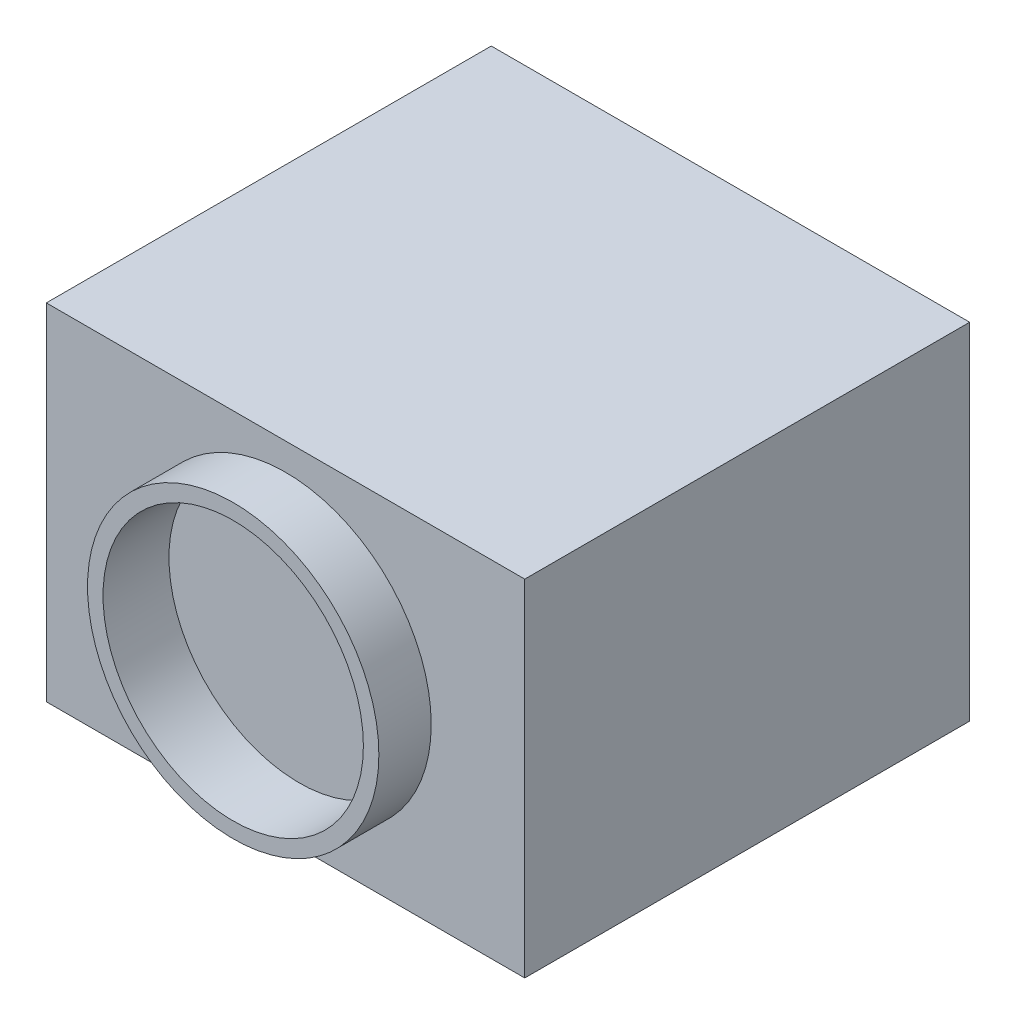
from build123d import *

# Parameters (mm, degrees)
SKETCH1_W      = 45.7
SKETCH1_H      = 33
EXTRUDE1_DEPTH = 42.5
SKETCH2_R      = 13.915073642
EXTRUDE2_DEPTH = 5
SKETCH3_R      = 5.780077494
SKETCH3_R_2    = 5.041446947
SKETCH3_W      = 13.242200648
SKETCH3_H      = 10.21733248
SKETCH3_W_2    = 10.956744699
SKETCH3_H_2    = 8.066315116
EXTRUDE3_DEPTH = 6.3
SKETCH5_R      = 12.435569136
EXTRUDE4_DEPTH = 6.3


with BuildPart() as part:
    # Sketch1 → Extrude1 (new body)
    with BuildSketch(Plane.XY):
        Rectangle(SKETCH1_W, SKETCH1_H)
    extrude(amount=EXTRUDE1_DEPTH)

    # Sketch2 → Extrude2 (add)
    with BuildSketch(Plane.XY.offset(42.5)):
        Circle(SKETCH2_R)
    extrude(amount=EXTRUDE2_DEPTH)

    # Sketch3 → Extrude3 (add)
    # profile 1 of 2: a face of its own
    with BuildSketch(Plane(origin=(0, 0, 0), x_dir=(-1, 0, 0), z_dir=(0, 0, -1))):
        with Locations(Location((13.511077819, 0, 0), (0, 0, 180))):
            Circle(SKETCH3_R)
        with Locations((13.511077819, 0)):
            Circle(SKETCH3_R_2, mode=Mode.SUBTRACT)
    # profile 2 of 2: a face of its own
    with BuildSketch(Plane(origin=(0, 0, 0), x_dir=(-1, 0, 0), z_dir=(0, 0, -1))):
        with Locations((-1.041899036, -10.553428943)):
            Rectangle(SKETCH3_W, SKETCH3_H)
        with Locations((-1.041899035, -10.553428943)):
            Rectangle(SKETCH3_W_2, SKETCH3_H_2, mode=Mode.SUBTRACT)
    extrude(amount=EXTRUDE3_DEPTH)

    # Sketch5 → Extrude4 (cut)
    with BuildSketch(Plane.XY.offset(47.5)):
        Circle(SKETCH5_R)
    extrude(amount=-EXTRUDE4_DEPTH, mode=Mode.SUBTRACT)


solid = part.part
